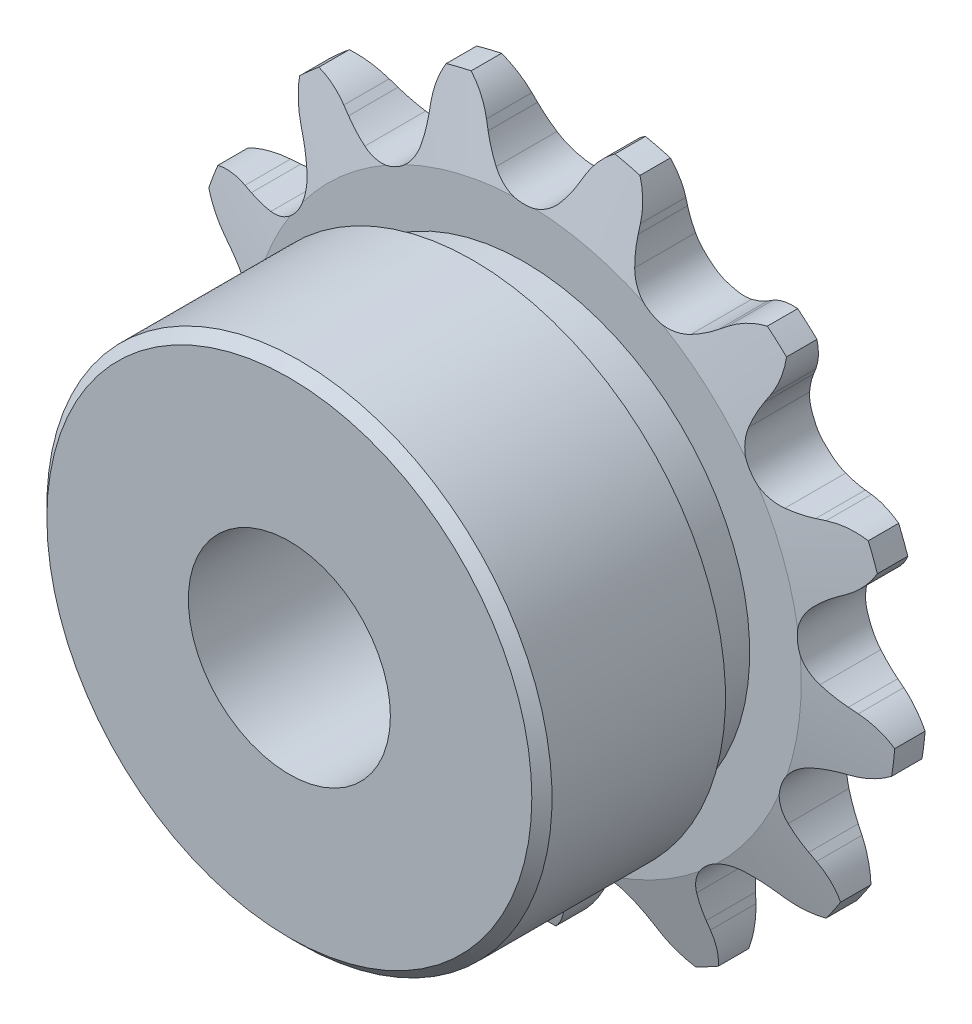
from build123d import *

# Parameters (mm, degrees)
CUT_EXTRUDE1_DEPTH      = 32.440209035
CIRPATTERN1_COUNT       = 13
BOSS_EXTRUDE1_START     = 2.1463
SKETCH2_R               = 15.875
BOSS_EXTRUDE1_DEPTH     = 14.7574
CUT_EXTRUDE2_DEPTH      = 36.582551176
CUT_EXTRUDE2_DEPTH_BACK = 36.582551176
SKETCH3_R               = 6.35
SKETCH4_W               = 3.21945
SKETCH4_H               = 8.001


with BuildPart() as part:
    # Sketch1 → Revolve1 (revolve)
    with BuildSketch(Plane(origin=(0, 0, 0), x_dir=(0, 0, -1), z_dir=(1, 0, 0)), mode=Mode.PRIVATE) as revolve1_sk:
        Polygon((2.1463, 0), (-2.1463, 0), (-2.1463, 17.41722205), (-0.955675, 22.17972205), (0.955675, 22.17972205), (2.1463, 17.41722205), align=None)
    revolve(revolve1_sk.sketch.rotate(Axis((0, 0, -2.1463), (0, 0, 1)), 90), axis=Axis((0, 0, -2.1463), (0, 0, 1)))

    # Sketch0 → Cut-Extrude1 (cut, symmetric)
    with BuildSketch(Plane.XY):
        with BuildLine():
            Line((7.794505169, -18.734735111), (7.458007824, -18.330417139))
            ThreePointArc((7.458007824, -18.330417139), (6.91407924, -17.75103617), (6.304964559, -17.240624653))
            ThreePointArc((6.304964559, -17.240624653), (4.142480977, -16.80670599), (2.429348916, -18.195878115))
            ThreePointArc((2.429348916, -18.195878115), (2.127204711, -18.930894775), (1.914831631, -19.696687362))
            Line((1.914831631, -19.696687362), (1.804773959, -20.21107126))
            ThreePointArc((1.804773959, -20.21107126), (0.117203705, -22.78103946), (-2.862298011, -23.539458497))
            ThreePointArc((-2.862298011, -23.539458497), (5.674854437, -23.023789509), (13.473770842, -19.512979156))
            ThreePointArc((13.473770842, -19.512979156), (10.483098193, -20.226075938), (7.794505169, -18.734735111))
        make_face()
    cut_extrude1 = extrude(amount=CUT_EXTRUDE1_DEPTH, both=True, mode=Mode.SUBTRACT)

    # CirPattern1: Cut-Extrude1 ×13 about axis
    cirpattern1_axis = Axis((0, 0, 0), (0, 0, 1))
    for i in range(1, CIRPATTERN1_COUNT):
        add(cut_extrude1.rotate(cirpattern1_axis, i * 360 / CIRPATTERN1_COUNT), mode=Mode.SUBTRACT)

    # Sketch2 → Boss-Extrude1 (add)
    with BuildSketch(Plane.XY.offset(BOSS_EXTRUDE1_START)):
        Circle(SKETCH2_R)
    extrude(amount=BOSS_EXTRUDE1_DEPTH)

    # Sketch3 → Cut-Extrude2 (cut, two sides: drawn at the far end of the back side and taken through both)
    with BuildSketch(Plane.XY.offset(-CUT_EXTRUDE2_DEPTH_BACK)):
        Circle(SKETCH3_R)
    extrude(amount=CUT_EXTRUDE2_DEPTH + CUT_EXTRUDE2_DEPTH_BACK, mode=Mode.SUBTRACT)

    # Sketch4 → Cut-Revolve1 (revolve, cut)
    with BuildSketch(Plane(origin=(0, 0, 0), x_dir=(0, 0, -1), z_dir=(1, 0, 0))):
        Polygon((-16.9037, 15.875), (-16.9037, 15.24), (-16.2687, 15.875), align=None)
        with Locations((-3.756025, 18.17922205)):
            Rectangle(SKETCH4_W, SKETCH4_H)
    revolve(axis=Axis((0, 0, -2.1463), (0, 0, 1)), mode=Mode.SUBTRACT)


solid = part.part
